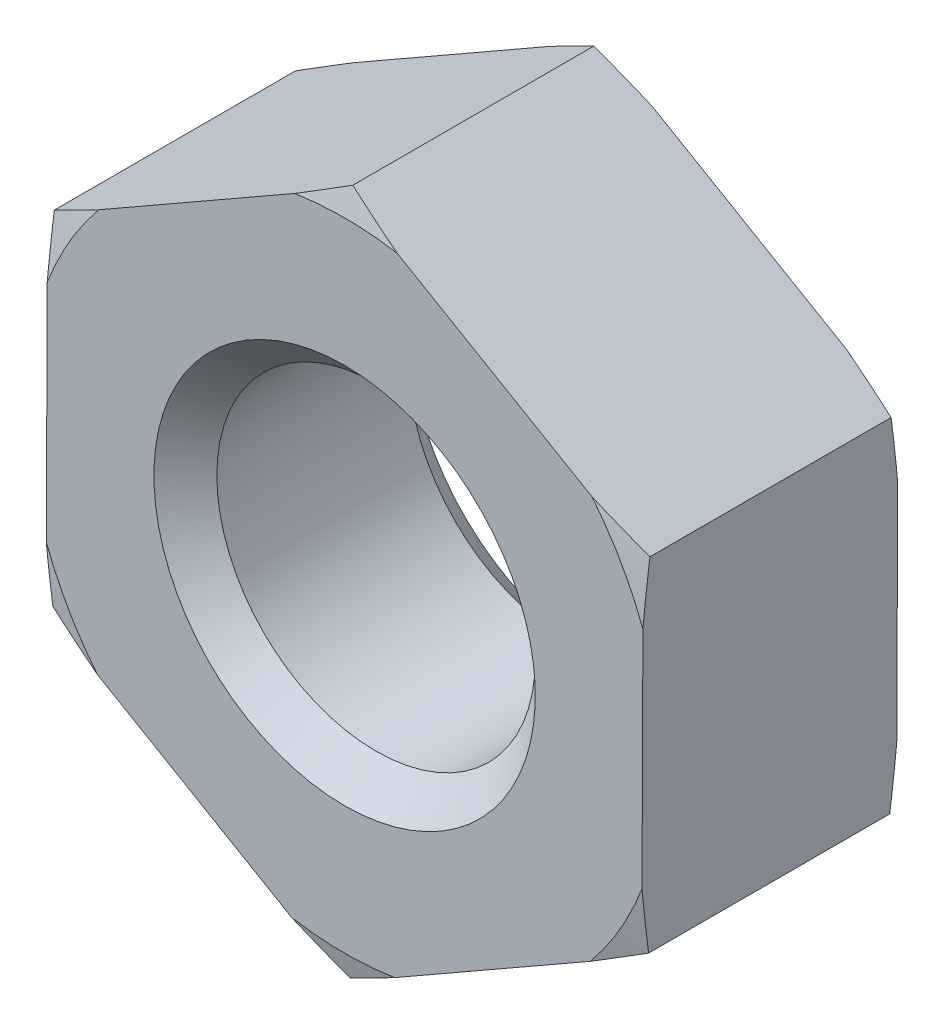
ISO-10303-21;
HEADER;
FILE_DESCRIPTION(('STEP AP214'),'2;1');
FILE_NAME('part.step','',(''),(''),'','','');
FILE_SCHEMA(('AUTOMOTIVE_DESIGN { 1 0 10303 214 1 1 1 1 }'));
ENDSEC;
DATA;
#1=APPLICATION_CONTEXT('core data for automotive mechanical design processes');
#2=APPLICATION_PROTOCOL_DEFINITION('international standard','automotive_design',2000,#1);
#3=PRODUCT_CONTEXT('',#1,'mechanical');
#4=PRODUCT('Part','Part','',(#3));
#5=PRODUCT_RELATED_PRODUCT_CATEGORY('part','',(#4));
#6=PRODUCT_DEFINITION_FORMATION('','',#4);
#7=PRODUCT_DEFINITION_CONTEXT('part definition',#1,'design');
#8=PRODUCT_DEFINITION('design','',#6,#7);
#9=PRODUCT_DEFINITION_SHAPE('','',#8);
#10=(LENGTH_UNIT() NAMED_UNIT(*) SI_UNIT(.MILLI.,.METRE.));
#11=(NAMED_UNIT(*) PLANE_ANGLE_UNIT() SI_UNIT($,.RADIAN.));
#12=(NAMED_UNIT(*) SI_UNIT($,.STERADIAN.) SOLID_ANGLE_UNIT());
#13=UNCERTAINTY_MEASURE_WITH_UNIT(LENGTH_MEASURE(1.E-05),#10,'distance_accuracy_value','');
#14=(GEOMETRIC_REPRESENTATION_CONTEXT(3) GLOBAL_UNCERTAINTY_ASSIGNED_CONTEXT((#13)) GLOBAL_UNIT_ASSIGNED_CONTEXT((#10,
#11,#12)) REPRESENTATION_CONTEXT('',''));
#15=CARTESIAN_POINT('',(0.,0.,0.));
#16=DIRECTION('',(0.,0.,1.));
#17=DIRECTION('',(1.,0.,0.));
#18=AXIS2_PLACEMENT_3D('',#15,#16,#17);
#19=CARTESIAN_POINT('',(0.,0.,1.13686837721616E-10));
#20=DIRECTION('',(0.,0.,-1.));
#21=DIRECTION('',(-1.,0.,0.));
#22=AXIS2_PLACEMENT_3D('',#19,#20,#21);
#23=CONICAL_SURFACE('',#22,1.19761904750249,0.785398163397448);
#24=CARTESIAN_POINT('',(0.,0.,0.197619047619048));
#25=DIRECTION('',(0.,0.,-1.));
#26=DIRECTION('',(-1.,0.,0.));
#27=AXIS2_PLACEMENT_3D('',#24,#25,#26);
#28=CIRCLE('',#27,1.);
#29=CARTESIAN_POINT('',(-1.,0.,0.197619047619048));
#30=VERTEX_POINT('',#29);
#31=EDGE_CURVE('E172',#30,#30,#28,.F.);
#32=ORIENTED_EDGE('',*,*,#31,.T.);
#33=EDGE_LOOP('',(#32));
#34=FACE_BOUND('',#33,.T.);
#35=CARTESIAN_POINT('',(0.,0.,5.6843418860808E-11));
#36=DIRECTION('',(0.,0.,-1.));
#37=DIRECTION('',(-1.,0.,0.));
#38=AXIS2_PLACEMENT_3D('',#35,#36,#37);
#39=CIRCLE('',#38,1.19761904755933);
#40=CARTESIAN_POINT('',(-1.19761904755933,0.,5.6843418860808E-11));
#41=VERTEX_POINT('',#40);
#42=EDGE_CURVE('E19',#41,#41,#39,.F.);
#43=ORIENTED_EDGE('',*,*,#42,.F.);
#44=EDGE_LOOP('',(#43));
#45=FACE_BOUND('',#44,.T.);
#46=ADVANCED_FACE('F16',(#34,#45),#23,.F.);
#47=CARTESIAN_POINT('',(0.,0.,1.6));
#48=DIRECTION('',(0.,0.,-1.));
#49=DIRECTION('',(-1.,0.,0.));
#50=AXIS2_PLACEMENT_3D('',#47,#48,#49);
#51=CYLINDRICAL_SURFACE('',#50,1.);
#52=ORIENTED_EDGE('',*,*,#31,.F.);
#53=EDGE_LOOP('',(#52));
#54=FACE_BOUND('',#53,.T.);
#55=CARTESIAN_POINT('',(0.,0.,1.4023809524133));
#56=DIRECTION('',(0.,0.,1.));
#57=DIRECTION('',(1.,0.,0.));
#58=AXIS2_PLACEMENT_3D('',#55,#56,#57);
#59=CIRCLE('',#58,0.999999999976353);
#60=CARTESIAN_POINT('',(0.999999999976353,0.,1.4023809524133));
#61=VERTEX_POINT('',#60);
#62=EDGE_CURVE('E165',#61,#61,#59,.T.);
#63=ORIENTED_EDGE('',*,*,#62,.T.);
#64=EDGE_LOOP('',(#63));
#65=FACE_BOUND('',#64,.T.);
#66=ADVANCED_FACE('F237',(#54,#65),#51,.F.);
#67=CARTESIAN_POINT('',(0.,0.,0.0431291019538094));
#68=DIRECTION('',(0.,0.,1.));
#69=DIRECTION('',(1.,0.,0.));
#70=AXIS2_PLACEMENT_3D('',#67,#68,#69);
#71=CONICAL_SURFACE('',#70,2.16095999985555,1.30899693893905);
#72=CARTESIAN_POINT('',(0.,0.,-2.84217229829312E-11));
#73=DIRECTION('',(0.,0.,1.));
#74=DIRECTION('',(1.,0.,0.));
#75=AXIS2_PLACEMENT_3D('',#72,#73,#74);
#76=CIRCLE('',#75,2.00000000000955);
#77=CARTESIAN_POINT('',(-0.314678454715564,1.97508923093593,-2.95567609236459E-11));
#78=VERTEX_POINT('',#77);
#79=CARTESIAN_POINT('',(0.33020715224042,1.97255246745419,-1.42108614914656E-11));
#80=VERTEX_POINT('',#79);
#81=EDGE_CURVE('E137',#78,#80,#76,.F.);
#82=ORIENTED_EDGE('',*,*,#81,.F.);
#83=CARTESIAN_POINT('',(-0.314678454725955,1.97508923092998,-3.06918093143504E-11));
#84=CARTESIAN_POINT('',(-0.287687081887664,1.99053146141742,0.0029481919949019));
#85=CARTESIAN_POINT('',(-0.260709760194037,2.00596565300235,0.00606500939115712));
#86=CARTESIAN_POINT('',(-0.206786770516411,2.03681592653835,0.0126169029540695));
#87=CARTESIAN_POINT('',(-0.179841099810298,2.05223201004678,0.0160519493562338));
#88=CARTESIAN_POINT('',(-0.125980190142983,2.08304676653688,0.0232218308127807));
#89=CARTESIAN_POINT('',(-0.0990649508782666,2.0984454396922,0.0269566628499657));
#90=CARTESIAN_POINT('',(-0.0452624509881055,2.12922677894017,0.0347078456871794));
#91=CARTESIAN_POINT('',(-0.018375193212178,2.14460944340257,0.0387242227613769));
#92=CARTESIAN_POINT('',(0.00849664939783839,2.15998328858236,0.0428718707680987));
#93=B_SPLINE_CURVE_WITH_KNOTS('',3,(#83,#84,#85,#86,#87,#88,#89,#90,#91,#92),.UNSPECIFIED.,.F.,
.F.,(4,2,2,2,4),(0.,0.0937072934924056,0.187405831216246,0.281103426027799,0.374809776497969),.UNSPECIFIED.);
#94=CARTESIAN_POINT('',(0.00849664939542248,2.15998328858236,0.0428718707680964));
#95=VERTEX_POINT('',#94);
#96=EDGE_CURVE('E140',#78,#95,#93,.T.);
#97=ORIENTED_EDGE('',*,*,#96,.T.);
#98=CARTESIAN_POINT('',(0.00849664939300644,2.15998328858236,0.0428718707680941));
#99=CARTESIAN_POINT('',(0.0352467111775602,2.14439851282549,0.0387242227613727));
#100=CARTESIAN_POINT('',(0.0620121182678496,2.12880479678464,0.0347078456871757));
#101=CARTESIAN_POINT('',(0.115570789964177,2.09760113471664,0.0269566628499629));
#102=CARTESIAN_POINT('',(0.14236405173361,2.08199119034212,0.0232218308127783));
#103=CARTESIAN_POINT('',(0.195980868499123,2.05075365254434,0.0160519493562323));
#104=CARTESIAN_POINT('',(0.22280442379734,2.03512605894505,0.0126169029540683));
#105=CARTESIAN_POINT('',(0.276483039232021,2.00385251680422,0.00606500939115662));
#106=CARTESIAN_POINT('',(0.303338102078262,1.98820656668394,0.00294819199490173));
#107=CARTESIAN_POINT('',(0.330207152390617,1.97255246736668,-3.06916143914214E-11));
#108=B_SPLINE_CURVE_WITH_KNOTS('',3,(#98,#99,#100,#101,#102,#103,#104,#105,#106,#107),
.UNSPECIFIED.,.F.,.F.,(4,2,2,2,4),(0.,0.0937063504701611,0.187403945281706,0.281102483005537,
0.374809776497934),.UNSPECIFIED.);
#109=EDGE_CURVE('E142',#95,#80,#108,.T.);
#110=ORIENTED_EDGE('',*,*,#109,.T.);
#111=EDGE_LOOP('',(#82,#97,#110));
#112=FACE_BOUND('',#111,.T.);
#113=ADVANCED_FACE('F139',(#112),#71,.T.);
#114=CARTESIAN_POINT('',(0.,0.,0.0431291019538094));
#115=DIRECTION('',(0.,0.,1.));
#116=DIRECTION('',(1.,0.,0.));
#117=AXIS2_PLACEMENT_3D('',#114,#115,#116);
#118=CONICAL_SURFACE('',#117,2.16095999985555,1.30899693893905);
#119=CARTESIAN_POINT('',(1.87484872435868,1.07263333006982,0.0428718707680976));
#120=CARTESIAN_POINT('',(1.87472694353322,1.04167470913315,0.0387242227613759));
#121=CARTESIAN_POINT('',(1.87460509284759,1.0106983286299,0.0347078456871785));
#122=CARTESIAN_POINT('',(1.87436126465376,0.948713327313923,0.0269566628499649));
#123=CARTESIAN_POINT('',(1.87423928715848,0.917704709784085,0.02322183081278));
#124=CARTESIAN_POINT('',(1.87399519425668,0.855652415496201,0.0160519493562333));
#125=CARTESIAN_POINT('',(1.87387307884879,0.824608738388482,0.0126169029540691));
#126=CARTESIAN_POINT('',(1.87362870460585,0.762484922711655,0.006065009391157));
#127=CARTESIAN_POINT('',(1.87350644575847,0.731404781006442,0.0029481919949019));
#128=CARTESIAN_POINT('',(1.87338412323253,0.700308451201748,-3.06917267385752E-11));
#129=B_SPLINE_CURVE_WITH_KNOTS('',3,(#119,#120,#121,#122,#123,#124,#125,#126,#127,#128),
.UNSPECIFIED.,.F.,.F.,(4,2,2,2,4),(0.,0.0937063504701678,0.187403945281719,0.281102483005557,
0.374809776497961),.UNSPECIFIED.);
#130=CARTESIAN_POINT('',(1.87484872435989,1.07263333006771,0.0428718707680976));
#131=VERTEX_POINT('',#130);
#132=CARTESIAN_POINT('',(1.87338412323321,0.700308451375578,-1.42108614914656E-11));
#133=VERTEX_POINT('',#132);
#134=EDGE_CURVE('E300',#131,#133,#129,.T.);
#135=ORIENTED_EDGE('',*,*,#134,.T.);
#136=CARTESIAN_POINT('',(0.,0.,-2.84217229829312E-11));
#137=DIRECTION('',(0.,0.,1.));
#138=DIRECTION('',(1.,0.,0.));
#139=AXIS2_PLACEMENT_3D('',#136,#137,#138);
#140=CIRCLE('',#139,2.00000000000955);
#141=CARTESIAN_POINT('',(1.5531382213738,1.26006415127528,-2.9556690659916E-11));
#142=VERTEX_POINT('',#141);
#143=EDGE_CURVE('E147',#142,#133,#140,.F.);
#144=ORIENTED_EDGE('',*,*,#143,.F.);
#145=CARTESIAN_POINT('',(1.55313822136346,1.2600641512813,-3.06916818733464E-11));
#146=CARTESIAN_POINT('',(1.58000727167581,1.24441005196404,0.00294819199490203));
#147=CARTESIAN_POINT('',(1.60686233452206,1.22876410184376,0.00606500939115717));
#148=CARTESIAN_POINT('',(1.66054094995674,1.19749055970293,0.0126169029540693));
#149=CARTESIAN_POINT('',(1.68736450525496,1.18186296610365,0.0160519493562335));
#150=CARTESIAN_POINT('',(1.74098132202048,1.15062542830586,0.0232218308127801));
#151=CARTESIAN_POINT('',(1.76777458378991,1.13501548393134,0.026956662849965));
#152=CARTESIAN_POINT('',(1.82133325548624,1.10381182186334,0.0347078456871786));
#153=CARTESIAN_POINT('',(1.84809866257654,1.08821810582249,0.038724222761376));
#154=CARTESIAN_POINT('',(1.87484872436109,1.07263333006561,0.0428718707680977));
#155=B_SPLINE_CURVE_WITH_KNOTS('',3,(#145,#146,#147,#148,#149,#150,#151,#152,#153,#154),
.UNSPECIFIED.,.F.,.F.,(4,2,2,2,4),(0.,0.0937072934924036,0.187405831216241,0.281103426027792,
0.37480977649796),.UNSPECIFIED.);
#156=EDGE_CURVE('E265',#142,#131,#155,.T.);
#157=ORIENTED_EDGE('',*,*,#156,.T.);
#158=EDGE_LOOP('',(#135,#144,#157));
#159=FACE_BOUND('',#158,.T.);
#160=ADVANCED_FACE('F244',(#159),#118,.T.);
#161=CARTESIAN_POINT('',(0.,0.,0.0431291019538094));
#162=DIRECTION('',(0.,0.,1.));
#163=DIRECTION('',(1.,0.,0.));
#164=AXIS2_PLACEMENT_3D('',#161,#162,#163);
#165=CONICAL_SURFACE('',#164,2.16095999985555,1.30899693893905);
#166=CARTESIAN_POINT('',(0.,0.,-2.84217229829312E-11));
#167=DIRECTION('',(0.,0.,1.));
#168=DIRECTION('',(1.,0.,0.));
#169=AXIS2_PLACEMENT_3D('',#166,#167,#168);
#170=CIRCLE('',#169,2.00000000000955);
#171=CARTESIAN_POINT('',(1.86781667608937,-0.715025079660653,-2.95567432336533E-11));
#172=VERTEX_POINT('',#171);
#173=CARTESIAN_POINT('',(1.5431769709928,-1.27224401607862,-1.42108614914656E-11));
#174=VERTEX_POINT('',#173);
#175=EDGE_CURVE('E670',#172,#174,#170,.F.);
#176=ORIENTED_EDGE('',*,*,#175,.F.);
#177=CARTESIAN_POINT('',(1.86781667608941,-0.715025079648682,-3.06917862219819E-11));
#178=CARTESIAN_POINT('',(1.86769435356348,-0.746121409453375,0.00294819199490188));
#179=CARTESIAN_POINT('',(1.8675720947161,-0.777201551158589,0.00606500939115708));
#180=CARTESIAN_POINT('',(1.86732772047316,-0.839325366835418,0.0126169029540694));
#181=CARTESIAN_POINT('',(1.86720560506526,-0.870369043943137,0.0160519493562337));
#182=CARTESIAN_POINT('',(1.86696151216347,-0.932421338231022,0.0232218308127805));
#183=CARTESIAN_POINT('',(1.86683953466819,-0.96342995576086,0.0269566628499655));
#184=CARTESIAN_POINT('',(1.86659570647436,-1.02541495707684,0.0347078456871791));
#185=CARTESIAN_POINT('',(1.86647385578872,-1.05639133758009,0.0387242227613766));
#186=CARTESIAN_POINT('',(1.86635207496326,-1.08734995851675,0.0428718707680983));
#187=B_SPLINE_CURVE_WITH_KNOTS('',3,(#177,#178,#179,#180,#181,#182,#183,#184,#185,#186),
.UNSPECIFIED.,.F.,.F.,(4,2,2,2,4),(0.,0.093707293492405,0.187405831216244,0.281103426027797,
0.374809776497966),.UNSPECIFIED.);
#188=CARTESIAN_POINT('',(1.86635207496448,-1.08734995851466,0.0428718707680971));
#189=VERTEX_POINT('',#188);
#190=EDGE_CURVE('E322',#172,#189,#187,.T.);
#191=ORIENTED_EDGE('',*,*,#190,.T.);
#192=CARTESIAN_POINT('',(1.86635207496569,-1.08734995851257,0.042871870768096));
#193=CARTESIAN_POINT('',(1.83948023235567,-1.10272380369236,0.0387242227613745));
#194=CARTESIAN_POINT('',(1.81259297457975,-1.11810646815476,0.0347078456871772));
#195=CARTESIAN_POINT('',(1.75879047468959,-1.14888780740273,0.026956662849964));
#196=CARTESIAN_POINT('',(1.73187523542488,-1.16428648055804,0.0232218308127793));
#197=CARTESIAN_POINT('',(1.67801432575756,-1.19510123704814,0.0160519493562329));
#198=CARTESIAN_POINT('',(1.65106865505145,-1.21051732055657,0.0126169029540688));
#199=CARTESIAN_POINT('',(1.59714566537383,-1.24136759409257,0.00606500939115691));
#200=CARTESIAN_POINT('',(1.5701683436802,-1.2568017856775,0.00294819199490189));
#201=CARTESIAN_POINT('',(1.54317697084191,-1.27224401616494,-3.06916982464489E-11));
#202=B_SPLINE_CURVE_WITH_KNOTS('',3,(#192,#193,#194,#195,#196,#197,#198,#199,#200,#201),
.UNSPECIFIED.,.F.,.F.,(4,2,2,2,4),(0.,0.0937063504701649,0.187403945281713,0.281102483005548,
0.374809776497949),.UNSPECIFIED.);
#203=EDGE_CURVE('E337',#189,#174,#202,.T.);
#204=ORIENTED_EDGE('',*,*,#203,.T.);
#205=EDGE_LOOP('',(#176,#191,#204));
#206=FACE_BOUND('',#205,.T.);
#207=ADVANCED_FACE('F327',(#206),#165,.T.);
#208=CARTESIAN_POINT('',(0.,0.,0.0431291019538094));
#209=DIRECTION('',(0.,0.,1.));
#210=DIRECTION('',(1.,0.,0.));
#211=AXIS2_PLACEMENT_3D('',#208,#209,#210);
#212=CONICAL_SURFACE('',#211,2.16095999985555,1.30899693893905);
#213=CARTESIAN_POINT('',(0.,0.,-2.84217229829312E-11));
#214=DIRECTION('',(0.,0.,1.));
#215=DIRECTION('',(1.,0.,0.));
#216=AXIS2_PLACEMENT_3D('',#213,#214,#215);
#217=CIRCLE('',#216,2.00000000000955);
#218=CARTESIAN_POINT('',(0.314678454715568,-1.97508923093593,-2.95567390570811E-11));
#219=VERTEX_POINT('',#218);
#220=CARTESIAN_POINT('',(-0.330207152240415,-1.97255246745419,-1.42108614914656E-11));
#221=VERTEX_POINT('',#220);
#222=EDGE_CURVE('E668',#219,#221,#217,.F.);
#223=ORIENTED_EDGE('',*,*,#222,.F.);
#224=CARTESIAN_POINT('',(0.314678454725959,-1.97508923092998,-3.06917586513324E-11));
#225=CARTESIAN_POINT('',(0.287687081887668,-1.99053146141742,0.00294819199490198));
#226=CARTESIAN_POINT('',(0.26070976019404,-2.00596565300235,0.00606500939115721));
#227=CARTESIAN_POINT('',(0.206786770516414,-2.03681592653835,0.0126169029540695));
#228=CARTESIAN_POINT('',(0.179841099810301,-2.05223201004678,0.0160519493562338));
#229=CARTESIAN_POINT('',(0.125980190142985,-2.08304676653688,0.0232218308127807));
#230=CARTESIAN_POINT('',(0.0990649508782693,-2.0984454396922,0.0269566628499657));
#231=CARTESIAN_POINT('',(0.0452624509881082,-2.12922677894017,0.0347078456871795));
#232=CARTESIAN_POINT('',(0.0183751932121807,-2.14460944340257,0.038724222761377));
#233=CARTESIAN_POINT('',(-0.0084966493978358,-2.15998328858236,0.0428718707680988));
#234=B_SPLINE_CURVE_WITH_KNOTS('',3,(#224,#225,#226,#227,#228,#229,#230,#231,#232,#233),
.UNSPECIFIED.,.F.,.F.,(4,2,2,2,4),(0.,0.0937072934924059,0.187405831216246,0.2811034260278,
0.37480977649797),.UNSPECIFIED.);
#235=CARTESIAN_POINT('',(-0.00849664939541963,-2.15998328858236,0.0428718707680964));
#236=VERTEX_POINT('',#235);
#237=EDGE_CURVE('E345',#219,#236,#234,.T.);
#238=ORIENTED_EDGE('',*,*,#237,.T.);
#239=CARTESIAN_POINT('',(-0.0084966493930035,-2.15998328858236,0.042871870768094));
#240=CARTESIAN_POINT('',(-0.0352467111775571,-2.14439851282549,0.0387242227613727));
#241=CARTESIAN_POINT('',(-0.0620121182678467,-2.12880479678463,0.0347078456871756));
#242=CARTESIAN_POINT('',(-0.115570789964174,-2.09760113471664,0.0269566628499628));
#243=CARTESIAN_POINT('',(-0.142364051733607,-2.08199119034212,0.0232218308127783));
#244=CARTESIAN_POINT('',(-0.19598086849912,-2.05075365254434,0.0160519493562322));
#245=CARTESIAN_POINT('',(-0.222804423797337,-2.03512605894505,0.0126169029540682));
#246=CARTESIAN_POINT('',(-0.276483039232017,-2.00385251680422,0.00606500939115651));
#247=CARTESIAN_POINT('',(-0.303338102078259,-1.98820656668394,0.00294819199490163));
#248=CARTESIAN_POINT('',(-0.330207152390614,-1.97255246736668,-3.06917094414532E-11));
#249=B_SPLINE_CURVE_WITH_KNOTS('',3,(#239,#240,#241,#242,#243,#244,#245,#246,#247,#248),
.UNSPECIFIED.,.F.,.F.,(4,2,2,2,4),(0.,0.093706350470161,0.187403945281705,0.281102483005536,
0.374809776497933),.UNSPECIFIED.);
#250=EDGE_CURVE('E377',#236,#221,#249,.T.);
#251=ORIENTED_EDGE('',*,*,#250,.T.);
#252=EDGE_LOOP('',(#223,#238,#251));
#253=FACE_BOUND('',#252,.T.);
#254=ADVANCED_FACE('F331',(#253),#212,.T.);
#255=CARTESIAN_POINT('',(0.,0.,0.0431291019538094));
#256=DIRECTION('',(0.,0.,1.));
#257=DIRECTION('',(1.,0.,0.));
#258=AXIS2_PLACEMENT_3D('',#255,#256,#257);
#259=CONICAL_SURFACE('',#258,2.16095999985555,1.30899693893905);
#260=CARTESIAN_POINT('',(0.,0.,-2.84217229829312E-11));
#261=DIRECTION('',(0.,0.,1.));
#262=DIRECTION('',(1.,0.,0.));
#263=AXIS2_PLACEMENT_3D('',#260,#261,#262);
#264=CIRCLE('',#263,2.00000000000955);
#265=CARTESIAN_POINT('',(-1.5531382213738,-1.26006415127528,-2.95567548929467E-11));
#266=VERTEX_POINT('',#265);
#267=CARTESIAN_POINT('',(-1.87338412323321,-0.700308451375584,-1.42108614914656E-11));
#268=VERTEX_POINT('',#267);
#269=EDGE_CURVE('E667',#266,#268,#264,.F.);
#270=ORIENTED_EDGE('',*,*,#269,.F.);
#271=CARTESIAN_POINT('',(-1.55313822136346,-1.2600641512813,-3.06917887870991E-11));
#272=CARTESIAN_POINT('',(-1.58000727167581,-1.24441005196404,0.00294819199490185));
#273=CARTESIAN_POINT('',(-1.60686233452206,-1.22876410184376,0.00606500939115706));
#274=CARTESIAN_POINT('',(-1.66054094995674,-1.19749055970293,0.0126169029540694));
#275=CARTESIAN_POINT('',(-1.68736450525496,-1.18186296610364,0.0160519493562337));
#276=CARTESIAN_POINT('',(-1.74098132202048,-1.15062542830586,0.0232218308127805));
#277=CARTESIAN_POINT('',(-1.76777458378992,-1.13501548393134,0.0269566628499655));
#278=CARTESIAN_POINT('',(-1.82133325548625,-1.10381182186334,0.0347078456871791));
#279=CARTESIAN_POINT('',(-1.84809866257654,-1.08821810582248,0.0387242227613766));
#280=CARTESIAN_POINT('',(-1.8748487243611,-1.07263333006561,0.0428718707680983));
#281=B_SPLINE_CURVE_WITH_KNOTS('',3,(#271,#272,#273,#274,#275,#276,#277,#278,#279,#280),
.UNSPECIFIED.,.F.,.F.,(4,2,2,2,4),(0.,0.0937072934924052,0.187405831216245,0.281103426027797,
0.374809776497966),.UNSPECIFIED.);
#282=CARTESIAN_POINT('',(-1.87484872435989,-1.0726333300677,0.042871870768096));
#283=VERTEX_POINT('',#282);
#284=EDGE_CURVE('E397',#266,#283,#281,.T.);
#285=ORIENTED_EDGE('',*,*,#284,.T.);
#286=CARTESIAN_POINT('',(-1.87484872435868,-1.07263333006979,0.0428718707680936));
#287=CARTESIAN_POINT('',(-1.87472694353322,-1.04167470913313,0.0387242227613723));
#288=CARTESIAN_POINT('',(-1.87460509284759,-1.01069832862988,0.0347078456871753));
#289=CARTESIAN_POINT('',(-1.87436126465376,-0.948713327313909,0.0269566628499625));
#290=CARTESIAN_POINT('',(-1.87423928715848,-0.917704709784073,0.023221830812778));
#291=CARTESIAN_POINT('',(-1.87399519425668,-0.855652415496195,0.0160519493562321));
#292=CARTESIAN_POINT('',(-1.87387307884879,-0.824608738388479,0.0126169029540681));
#293=CARTESIAN_POINT('',(-1.87362870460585,-0.762484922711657,0.00606500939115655));
#294=CARTESIAN_POINT('',(-1.87350644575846,-0.731404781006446,0.00294819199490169));
#295=CARTESIAN_POINT('',(-1.87338412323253,-0.700308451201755,-3.06916858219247E-11));
#296=B_SPLINE_CURVE_WITH_KNOTS('',3,(#286,#287,#288,#289,#290,#291,#292,#293,#294,#295),
.UNSPECIFIED.,.F.,.F.,(4,2,2,2,4),(0.,0.0937063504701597,0.187403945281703,0.281102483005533,
0.374809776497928),.UNSPECIFIED.);
#297=EDGE_CURVE('E410',#283,#268,#296,.T.);
#298=ORIENTED_EDGE('',*,*,#297,.T.);
#299=EDGE_LOOP('',(#270,#285,#298));
#300=FACE_BOUND('',#299,.T.);
#301=ADVANCED_FACE('F402',(#300),#259,.T.);
#302=CARTESIAN_POINT('',(1.87484872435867,1.07263333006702,0.));
#303=DIRECTION('',(0.,0.,-1.));
#304=DIRECTION('',(-1.,0.,0.));
#305=AXIS2_PLACEMENT_3D('',#302,#303,#304);
#306=PLANE('',#305);
#307=DIRECTION('',(-0.864051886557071,0.503402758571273,0.));
#308=VECTOR('',#307,1.);
#309=CARTESIAN_POINT('',(-1.87484872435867,-1.07263333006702,0.));
#310=LINE('',#309,#308);
#311=EDGE_CURVE('E401',#221,#266,#310,.T.);
#312=ORIENTED_EDGE('',*,*,#311,.T.);
#313=ORIENTED_EDGE('',*,*,#269,.T.);
#314=DIRECTION('',(0.00393363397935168,0.999992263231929,0.));
#315=VECTOR('',#314,1.);
#316=CARTESIAN_POINT('',(-1.86635207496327,1.08734995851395,0.));
#317=LINE('',#316,#315);
#318=CARTESIAN_POINT('',(-1.86781667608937,0.715025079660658,-2.95566867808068E-11));
#319=VERTEX_POINT('',#318);
#320=EDGE_CURVE('E415',#268,#319,#317,.T.);
#321=ORIENTED_EDGE('',*,*,#320,.T.);
#322=CARTESIAN_POINT('',(0.,0.,-2.84217229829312E-11));
#323=DIRECTION('',(0.,0.,1.));
#324=DIRECTION('',(1.,0.,0.));
#325=AXIS2_PLACEMENT_3D('',#322,#323,#324);
#326=CIRCLE('',#325,2.00000000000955);
#327=CARTESIAN_POINT('',(-1.5431769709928,1.27224401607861,-1.42108614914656E-11));
#328=VERTEX_POINT('',#327);
#329=EDGE_CURVE('E162',#328,#319,#326,.T.);
#330=ORIENTED_EDGE('',*,*,#329,.F.);
#331=DIRECTION('',(0.867985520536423,0.496589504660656,0.));
#332=VECTOR('',#331,1.);
#333=CARTESIAN_POINT('',(0.008496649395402,2.15998328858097,0.));
#334=LINE('',#333,#332);
#335=EDGE_CURVE('E152',#328,#78,#334,.T.);
#336=ORIENTED_EDGE('',*,*,#335,.T.);
#337=ORIENTED_EDGE('',*,*,#81,.T.);
#338=DIRECTION('',(0.86405188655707,-0.503402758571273,0.));
#339=VECTOR('',#338,1.);
#340=CARTESIAN_POINT('',(1.87484872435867,1.07263333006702,0.));
#341=LINE('',#340,#339);
#342=EDGE_CURVE('E264',#80,#142,#341,.T.);
#343=ORIENTED_EDGE('',*,*,#342,.T.);
#344=ORIENTED_EDGE('',*,*,#143,.T.);
#345=DIRECTION('',(-0.00393363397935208,-0.999992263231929,0.));
#346=VECTOR('',#345,1.);
#347=CARTESIAN_POINT('',(1.86635207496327,-1.08734995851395,0.));
#348=LINE('',#347,#346);
#349=EDGE_CURVE('E326',#133,#172,#348,.T.);
#350=ORIENTED_EDGE('',*,*,#349,.T.);
#351=ORIENTED_EDGE('',*,*,#175,.T.);
#352=DIRECTION('',(-0.867985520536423,-0.496589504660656,0.));
#353=VECTOR('',#352,1.);
#354=CARTESIAN_POINT('',(-0.00849664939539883,-2.15998328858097,0.));
#355=LINE('',#354,#353);
#356=EDGE_CURVE('E343',#174,#219,#355,.T.);
#357=ORIENTED_EDGE('',*,*,#356,.T.);
#358=ORIENTED_EDGE('',*,*,#222,.T.);
#359=EDGE_LOOP('',(#312,#313,#321,#330,#336,#337,#343,#344,#350,#351,#357,#358));
#360=FACE_BOUND('',#359,.T.);
#361=ORIENTED_EDGE('',*,*,#42,.T.);
#362=EDGE_LOOP('',(#361));
#363=FACE_BOUND('',#362,.T.);
#364=ADVANCED_FACE('F159',(#360,#363),#306,.T.);
#365=CARTESIAN_POINT('',(0.,0.,0.0431291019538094));
#366=DIRECTION('',(0.,0.,1.));
#367=DIRECTION('',(1.,0.,0.));
#368=AXIS2_PLACEMENT_3D('',#365,#366,#367);
#369=CONICAL_SURFACE('',#368,2.16095999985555,1.30899693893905);
#370=ORIENTED_EDGE('',*,*,#329,.T.);
#371=CARTESIAN_POINT('',(-1.86781667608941,0.715025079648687,-3.06916531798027E-11));
#372=CARTESIAN_POINT('',(-1.86769435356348,0.746121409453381,0.00294819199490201));
#373=CARTESIAN_POINT('',(-1.8675720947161,0.777201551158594,0.0060650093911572));
#374=CARTESIAN_POINT('',(-1.86732772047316,0.839325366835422,0.0126169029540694));
#375=CARTESIAN_POINT('',(-1.86720560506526,0.870369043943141,0.0160519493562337));
#376=CARTESIAN_POINT('',(-1.86696151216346,0.932421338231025,0.0232218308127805));
#377=CARTESIAN_POINT('',(-1.86683953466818,0.963429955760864,0.0269566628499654));
#378=CARTESIAN_POINT('',(-1.86659570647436,1.02541495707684,0.034707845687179));
#379=CARTESIAN_POINT('',(-1.86647385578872,1.05639133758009,0.0387242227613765));
#380=CARTESIAN_POINT('',(-1.86635207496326,1.08734995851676,0.0428718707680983));
#381=B_SPLINE_CURVE_WITH_KNOTS('',3,(#371,#372,#373,#374,#375,#376,#377,#378,#379,#380),
.UNSPECIFIED.,.F.,.F.,(4,2,2,2,4),(0.,0.0937072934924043,0.187405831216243,0.281103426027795,
0.374809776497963),.UNSPECIFIED.);
#382=CARTESIAN_POINT('',(-1.86635207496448,1.08734995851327,0.0428718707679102));
#383=VERTEX_POINT('',#382);
#384=EDGE_CURVE('E417',#319,#383,#381,.T.);
#385=ORIENTED_EDGE('',*,*,#384,.T.);
#386=CARTESIAN_POINT('',(-1.86635207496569,1.08734995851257,0.0428718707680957));
#387=CARTESIAN_POINT('',(-1.83948023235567,1.10272380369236,0.0387242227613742));
#388=CARTESIAN_POINT('',(-1.81259297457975,1.11810646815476,0.034707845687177));
#389=CARTESIAN_POINT('',(-1.75879047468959,1.14888780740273,0.0269566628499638));
#390=CARTESIAN_POINT('',(-1.73187523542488,1.16428648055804,0.0232218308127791));
#391=CARTESIAN_POINT('',(-1.67801432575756,1.19510123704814,0.0160519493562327));
#392=CARTESIAN_POINT('',(-1.65106865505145,1.21051732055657,0.0126169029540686));
#393=CARTESIAN_POINT('',(-1.59714566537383,1.24136759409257,0.00606500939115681));
#394=CARTESIAN_POINT('',(-1.5701683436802,1.2568017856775,0.00294819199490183));
#395=CARTESIAN_POINT('',(-1.54317697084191,1.27224401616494,-3.0691704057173E-11));
#396=B_SPLINE_CURVE_WITH_KNOTS('',3,(#386,#387,#388,#389,#390,#391,#392,#393,#394,#395),
.UNSPECIFIED.,.F.,.F.,(4,2,2,2,4),(0.,0.0937063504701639,0.187403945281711,0.281102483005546,
0.374809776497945),.UNSPECIFIED.);
#397=EDGE_CURVE('E163',#383,#328,#396,.T.);
#398=ORIENTED_EDGE('',*,*,#397,.T.);
#399=EDGE_LOOP('',(#370,#385,#398));
#400=FACE_BOUND('',#399,.T.);
#401=ADVANCED_FACE('F233',(#400),#369,.T.);
#402=CARTESIAN_POINT('',(0.,0.,1.60000000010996));
#403=DIRECTION('',(0.,0.,1.));
#404=DIRECTION('',(0.,-1.,0.));
#405=AXIS2_PLACEMENT_3D('',#402,#403,#404);
#406=CONICAL_SURFACE('',#405,1.19761904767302,0.785398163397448);
#407=CARTESIAN_POINT('',(0.,0.,1.60000000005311));
#408=DIRECTION('',(0.,0.,1.));
#409=DIRECTION('',(0.,-1.,0.));
#410=AXIS2_PLACEMENT_3D('',#407,#408,#409);
#411=CIRCLE('',#410,1.19761904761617);
#412=CARTESIAN_POINT('',(0.,-1.19761904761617,1.60000000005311));
#413=VERTEX_POINT('',#412);
#414=EDGE_CURVE('E195',#413,#413,#411,.T.);
#415=ORIENTED_EDGE('',*,*,#414,.T.);
#416=EDGE_LOOP('',(#415));
#417=FACE_BOUND('',#416,.T.);
#418=ORIENTED_EDGE('',*,*,#62,.F.);
#419=EDGE_LOOP('',(#418));
#420=FACE_BOUND('',#419,.T.);
#421=ADVANCED_FACE('F230',(#417,#420),#406,.F.);
#422=CARTESIAN_POINT('',(0.008496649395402,2.15998328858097,1.6));
#423=DIRECTION('',(0.496589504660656,-0.867985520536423,0.));
#424=DIRECTION('',(0.867985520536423,0.496589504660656,0.));
#425=AXIS2_PLACEMENT_3D('',#422,#423,#424);
#426=PLANE('',#425);
#427=DIRECTION('',(0.,0.,1.));
#428=VECTOR('',#427,1.);
#429=CARTESIAN_POINT('',(0.00849664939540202,2.15998328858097,1.6));
#430=LINE('',#429,#428);
#431=CARTESIAN_POINT('',(0.00849664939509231,2.15998328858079,1.5571281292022));
#432=VERTEX_POINT('',#431);
#433=EDGE_CURVE('E155',#432,#95,#430,.F.);
#434=ORIENTED_EDGE('',*,*,#433,.T.);
#435=ORIENTED_EDGE('',*,*,#96,.F.);
#436=ORIENTED_EDGE('',*,*,#335,.F.);
#437=ORIENTED_EDGE('',*,*,#397,.F.);
#438=DIRECTION('',(0.,0.,1.));
#439=VECTOR('',#438,1.);
#440=CARTESIAN_POINT('',(-1.86635207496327,1.08734995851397,1.6));
#441=LINE('',#440,#439);
#442=CARTESIAN_POINT('',(-1.86635203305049,1.08734998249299,1.55712813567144));
#443=VERTEX_POINT('',#442);
#444=EDGE_CURVE('E445',#383,#443,#441,.T.);
#445=ORIENTED_EDGE('',*,*,#444,.T.);
#446=CARTESIAN_POINT('',(-1.54317697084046,1.27224401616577,1.5999999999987));
#447=CARTESIAN_POINT('',(-1.57016833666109,1.25680178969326,1.59705180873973));
#448=CARTESIAN_POINT('',(-1.59714565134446,1.24136760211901,1.59393499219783));
#449=CARTESIAN_POINT('',(-1.65106862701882,1.21051733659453,1.58738310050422));
#450=CARTESIAN_POINT('',(-1.67801429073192,1.19510125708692,1.58394805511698));
#451=CARTESIAN_POINT('',(-1.73187518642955,1.16428650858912,1.57677817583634));
#452=CARTESIAN_POINT('',(-1.75879041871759,1.14888783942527,1.57304334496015));
#453=CARTESIAN_POINT('',(-1.81259290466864,1.11810650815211,1.56529216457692));
#454=CARTESIAN_POINT('',(-1.83948015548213,1.10272384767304,1.56127578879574));
#455=CARTESIAN_POINT('',(-1.8663519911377,1.08735000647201,1.55712814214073));
#456=B_SPLINE_CURVE_WITH_KNOTS('',3,(#446,#447,#448,#449,#450,#451,#452,#453,#454,#455),
.UNSPECIFIED.,.F.,.F.,(4,2,2,2,4),(0.,0.0937072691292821,0.187405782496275,0.281103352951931,
0.374809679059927),.UNSPECIFIED.);
#457=CARTESIAN_POINT('',(-1.54317697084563,1.27224401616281,1.59999999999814));
#458=VERTEX_POINT('',#457);
#459=EDGE_CURVE('E204',#458,#443,#456,.T.);
#460=ORIENTED_EDGE('',*,*,#459,.F.);
#461=DIRECTION('',(0.867985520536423,0.496589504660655,0.));
#462=VECTOR('',#461,1.);
#463=CARTESIAN_POINT('',(-1.54317697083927,1.27224401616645,1.6));
#464=LINE('',#463,#462);
#465=CARTESIAN_POINT('',(-0.314678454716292,1.97508923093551,1.59999999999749));
#466=VERTEX_POINT('',#465);
#467=EDGE_CURVE('E194',#458,#466,#464,.T.);
#468=ORIENTED_EDGE('',*,*,#467,.T.);
#469=CARTESIAN_POINT('',(0.0084966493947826,2.15998328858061,1.55712812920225));
#470=CARTESIAN_POINT('',(-0.0183751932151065,2.1446094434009,1.56127577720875));
#471=CARTESIAN_POINT('',(-0.0452624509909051,2.12922677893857,1.56529215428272));
#472=CARTESIAN_POINT('',(-0.0990649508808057,2.09844543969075,1.57304333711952));
#473=CARTESIAN_POINT('',(-0.12598019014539,2.08304676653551,1.5767781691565));
#474=CARTESIAN_POINT('',(-0.179841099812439,2.05223201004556,1.58394805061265));
#475=CARTESIAN_POINT('',(-0.206786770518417,2.0368159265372,1.58738309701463));
#476=CARTESIAN_POINT('',(-0.26070976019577,2.00596565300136,1.59393499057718));
#477=CARTESIAN_POINT('',(-0.287687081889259,1.9905314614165,1.59705180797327));
#478=CARTESIAN_POINT('',(-0.314678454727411,1.97508923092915,1.5999999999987));
#479=B_SPLINE_CURVE_WITH_KNOTS('',3,(#469,#470,#471,#472,#473,#474,#475,#476,#477,#478),
.UNSPECIFIED.,.F.,.F.,(4,2,2,2,4),(0.,0.0937063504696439,0.187403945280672,0.281102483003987,
0.374809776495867),.UNSPECIFIED.);
#480=EDGE_CURVE('E156',#432,#466,#479,.T.);
#481=ORIENTED_EDGE('',*,*,#480,.F.);
#482=EDGE_LOOP('',(#434,#435,#436,#437,#445,#460,#468,#481));
#483=FACE_BOUND('',#482,.T.);
#484=ADVANCED_FACE('F151',(#483),#426,.F.);
#485=CARTESIAN_POINT('',(0.,0.,1.55687089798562));
#486=DIRECTION('',(0.,0.,-1.));
#487=DIRECTION('',(0.,1.,0.));
#488=AXIS2_PLACEMENT_3D('',#485,#486,#487);
#489=CONICAL_SURFACE('',#488,2.16095999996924,1.30899693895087);
#490=ORIENTED_EDGE('',*,*,#480,.T.);
#491=CARTESIAN_POINT('',(0.,0.,1.59999999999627));
#492=DIRECTION('',(0.,0.,-1.));
#493=DIRECTION('',(0.,1.,0.));
#494=AXIS2_PLACEMENT_3D('',#491,#492,#493);
#495=CIRCLE('',#494,2.00000000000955);
#496=CARTESIAN_POINT('',(0.330207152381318,1.9725524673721,1.59999999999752));
#497=VERTEX_POINT('',#496);
#498=EDGE_CURVE('E191',#466,#497,#495,.T.);
#499=ORIENTED_EDGE('',*,*,#498,.T.);
#500=CARTESIAN_POINT('',(0.330207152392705,1.97255246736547,1.59999999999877));
#501=CARTESIAN_POINT('',(0.303338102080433,1.98820656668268,1.59705180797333));
#502=CARTESIAN_POINT('',(0.276483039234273,2.00385251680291,1.59393499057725));
#503=CARTESIAN_POINT('',(0.222804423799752,2.03512605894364,1.58738309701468));
#504=CARTESIAN_POINT('',(0.195980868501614,2.05075365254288,1.5839480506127));
#505=CARTESIAN_POINT('',(0.142364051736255,2.08199119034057,1.57677816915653));
#506=CARTESIAN_POINT('',(0.115570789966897,2.09760113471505,1.57304333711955));
#507=CARTESIAN_POINT('',(0.0620121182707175,2.12880479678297,1.56529215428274));
#508=CARTESIAN_POINT('',(0.0352467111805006,2.14439851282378,1.56127577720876));
#509=CARTESIAN_POINT('',(0.00849664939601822,2.15998328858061,1.55712812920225));
#510=B_SPLINE_CURVE_WITH_KNOTS('',3,(#500,#501,#502,#503,#504,#505,#506,#507,#508,#509),
.UNSPECIFIED.,.F.,.F.,(4,2,2,2,4),(0.,0.0937072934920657,0.187405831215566,0.28110342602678,
0.37480977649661),.UNSPECIFIED.);
#511=EDGE_CURVE('E270',#497,#432,#510,.T.);
#512=ORIENTED_EDGE('',*,*,#511,.T.);
#513=EDGE_LOOP('',(#490,#499,#512));
#514=FACE_BOUND('',#513,.T.);
#515=ADVANCED_FACE('F280',(#514),#489,.T.);
#516=CARTESIAN_POINT('',(1.87484872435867,1.07263333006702,1.6));
#517=DIRECTION('',(-0.503402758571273,-0.86405188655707,0.));
#518=DIRECTION('',(0.86405188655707,-0.503402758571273,0.));
#519=AXIS2_PLACEMENT_3D('',#516,#517,#518);
#520=PLANE('',#519);
#521=DIRECTION('',(0.,0.,1.));
#522=VECTOR('',#521,1.);
#523=CARTESIAN_POINT('',(1.87484872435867,1.07263333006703,1.6));
#524=LINE('',#523,#522);
#525=CARTESIAN_POINT('',(1.87484868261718,1.07263335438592,1.55712813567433));
#526=VERTEX_POINT('',#525);
#527=EDGE_CURVE('E299',#526,#131,#524,.F.);
#528=ORIENTED_EDGE('',*,*,#527,.T.);
#529=ORIENTED_EDGE('',*,*,#156,.F.);
#530=ORIENTED_EDGE('',*,*,#342,.F.);
#531=ORIENTED_EDGE('',*,*,#109,.F.);
#532=ORIENTED_EDGE('',*,*,#433,.F.);
#533=ORIENTED_EDGE('',*,*,#511,.F.);
#534=DIRECTION('',(0.86405188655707,-0.503402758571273,0.));
#535=VECTOR('',#534,1.);
#536=CARTESIAN_POINT('',(0.33020715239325,1.97255246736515,1.6));
#537=LINE('',#536,#535);
#538=CARTESIAN_POINT('',(1.55313822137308,1.2600641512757,1.59999999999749));
#539=VERTEX_POINT('',#538);
#540=EDGE_CURVE('E190',#497,#539,#537,.T.);
#541=ORIENTED_EDGE('',*,*,#540,.T.);
#542=CARTESIAN_POINT('',(1.87484864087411,1.07263337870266,1.55712814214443));
#543=CARTESIAN_POINT('',(1.84809858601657,1.08821815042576,1.56127578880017));
#544=CARTESIAN_POINT('',(1.82133318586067,1.10381186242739,1.56529216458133));
#545=CARTESIAN_POINT('',(1.76777452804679,1.13501551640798,1.57304334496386));
#546=CARTESIAN_POINT('',(1.7409812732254,1.15062545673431,1.57677817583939));
#547=CARTESIAN_POINT('',(1.68736447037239,1.18186298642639,1.58394805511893));
#548=CARTESIAN_POINT('',(1.66054092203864,1.19749057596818,1.58738310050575));
#549=CARTESIAN_POINT('',(1.60686232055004,1.228764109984,1.59393499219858));
#550=CARTESIAN_POINT('',(1.58000726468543,1.24441005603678,1.59705180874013));
#551=CARTESIAN_POINT('',(1.55313822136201,1.26006415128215,1.5999999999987));
#552=B_SPLINE_CURVE_WITH_KNOTS('',3,(#542,#543,#544,#545,#546,#547,#548,#549,#550,#551),
.UNSPECIFIED.,.F.,.F.,(4,2,2,2,4),(0.,0.0937063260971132,0.187403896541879,0.281102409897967,
0.37480967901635),.UNSPECIFIED.);
#553=EDGE_CURVE('E287',#526,#539,#552,.T.);
#554=ORIENTED_EDGE('',*,*,#553,.F.);
#555=EDGE_LOOP('',(#528,#529,#530,#531,#532,#533,#541,#554));
#556=FACE_BOUND('',#555,.T.);
#557=ADVANCED_FACE('F275',(#556),#520,.F.);
#558=CARTESIAN_POINT('',(0.,0.,1.55687089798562));
#559=DIRECTION('',(0.,0.,-1.));
#560=DIRECTION('',(0.,1.,0.));
#561=AXIS2_PLACEMENT_3D('',#558,#559,#560);
#562=CONICAL_SURFACE('',#561,2.16095999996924,1.30899693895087);
#563=CARTESIAN_POINT('',(0.,0.,1.59999999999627));
#564=DIRECTION('',(0.,0.,-1.));
#565=DIRECTION('',(0.,1.,0.));
#566=AXIS2_PLACEMENT_3D('',#563,#564,#565);
#567=CIRCLE('',#566,2.00000000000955);
#568=CARTESIAN_POINT('',(1.87338412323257,0.700308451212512,1.59999999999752));
#569=VERTEX_POINT('',#568);
#570=EDGE_CURVE('E187',#539,#569,#567,.T.);
#571=ORIENTED_EDGE('',*,*,#570,.T.);
#572=CARTESIAN_POINT('',(1.87338412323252,0.700308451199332,1.59999999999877));
#573=CARTESIAN_POINT('',(1.8735064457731,0.731404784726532,1.59705180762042));
#574=CARTESIAN_POINT('',(1.87362870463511,0.762484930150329,1.59393498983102));
#575=CARTESIAN_POINT('',(1.87387307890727,0.824608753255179,1.58738309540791));
#576=CARTESIAN_POINT('',(1.87399519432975,0.855652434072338,1.5839480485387));
#577=CARTESIAN_POINT('',(1.8742392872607,0.917704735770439,1.57677816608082));
#578=CARTESIAN_POINT('',(1.87436126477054,0.948713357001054,1.57304333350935));
#579=CARTESIAN_POINT('',(1.87460509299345,1.01069836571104,1.56529214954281));
#580=CARTESIAN_POINT('',(1.87472694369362,1.04167474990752,1.56127577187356));
#581=CARTESIAN_POINT('',(1.87484872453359,1.07263337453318,1.55712812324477));
#582=B_SPLINE_CURVE_WITH_KNOTS('',3,(#572,#573,#574,#575,#576,#577,#578,#579,#580,#581),
.UNSPECIFIED.,.F.,.F.,(4,2,2,2,4),(0.,0.0937073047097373,0.187405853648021,0.28110345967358,
0.374809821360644),.UNSPECIFIED.);
#583=EDGE_CURVE('E293',#569,#526,#582,.T.);
#584=ORIENTED_EDGE('',*,*,#583,.T.);
#585=ORIENTED_EDGE('',*,*,#553,.T.);
#586=EDGE_LOOP('',(#571,#584,#585));
#587=FACE_BOUND('',#586,.T.);
#588=ADVANCED_FACE('F279',(#587),#562,.T.);
#589=CARTESIAN_POINT('',(1.86635207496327,-1.08734995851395,1.6));
#590=DIRECTION('',(-0.999992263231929,0.00393363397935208,0.));
#591=DIRECTION('',(-0.00393363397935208,-0.999992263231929,0.));
#592=AXIS2_PLACEMENT_3D('',#589,#590,#591);
#593=PLANE('',#592);
#594=DIRECTION('',(0.,0.,1.));
#595=VECTOR('',#594,1.);
#596=CARTESIAN_POINT('',(1.86635207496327,-1.08734995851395,1.6));
#597=LINE('',#596,#595);
#598=CARTESIAN_POINT('',(1.86635207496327,-1.08734995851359,1.5571281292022));
#599=VERTEX_POINT('',#598);
#600=EDGE_CURVE('E344',#599,#189,#597,.F.);
#601=ORIENTED_EDGE('',*,*,#600,.T.);
#602=ORIENTED_EDGE('',*,*,#190,.F.);
#603=ORIENTED_EDGE('',*,*,#349,.F.);
#604=ORIENTED_EDGE('',*,*,#134,.F.);
#605=ORIENTED_EDGE('',*,*,#527,.F.);
#606=ORIENTED_EDGE('',*,*,#583,.F.);
#607=DIRECTION('',(-0.00393363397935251,-0.999992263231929,0.));
#608=VECTOR('',#607,1.);
#609=CARTESIAN_POINT('',(1.87338412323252,0.700308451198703,1.6));
#610=LINE('',#609,#608);
#611=CARTESIAN_POINT('',(1.86781667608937,-0.715025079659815,1.59999999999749));
#612=VERTEX_POINT('',#611);
#613=EDGE_CURVE('E186',#569,#612,#610,.T.);
#614=ORIENTED_EDGE('',*,*,#613,.T.);
#615=CARTESIAN_POINT('',(1.86635207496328,-1.08734995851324,1.55712812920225));
#616=CARTESIAN_POINT('',(1.86647385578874,-1.05639133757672,1.56127577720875));
#617=CARTESIAN_POINT('',(1.86659570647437,-1.02541495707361,1.56529215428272));
#618=CARTESIAN_POINT('',(1.8668395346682,-0.963429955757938,1.57304333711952));
#619=CARTESIAN_POINT('',(1.86696151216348,-0.932421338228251,1.5767781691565));
#620=CARTESIAN_POINT('',(1.86720560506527,-0.870369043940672,1.58394805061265));
#621=CARTESIAN_POINT('',(1.86732772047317,-0.839325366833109,1.58738309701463));
#622=CARTESIAN_POINT('',(1.8675720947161,-0.777201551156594,1.59393499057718));
#623=CARTESIAN_POINT('',(1.86769435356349,-0.746121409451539,1.59705180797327));
#624=CARTESIAN_POINT('',(1.86781667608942,-0.715025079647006,1.5999999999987));
#625=B_SPLINE_CURVE_WITH_KNOTS('',3,(#615,#616,#617,#618,#619,#620,#621,#622,#623,#624),
.UNSPECIFIED.,.F.,.F.,(4,2,2,2,4),(0.,0.0937063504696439,0.187403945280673,0.281102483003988,
0.374809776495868),.UNSPECIFIED.);
#626=EDGE_CURVE('E316',#599,#612,#625,.T.);
#627=ORIENTED_EDGE('',*,*,#626,.F.);
#628=EDGE_LOOP('',(#601,#602,#603,#604,#605,#606,#614,#627));
#629=FACE_BOUND('',#628,.T.);
#630=ADVANCED_FACE('F305',(#629),#593,.F.);
#631=CARTESIAN_POINT('',(0.,0.,1.55687089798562));
#632=DIRECTION('',(0.,0.,-1.));
#633=DIRECTION('',(0.,1.,0.));
#634=AXIS2_PLACEMENT_3D('',#631,#632,#633);
#635=CONICAL_SURFACE('',#634,2.16095999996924,1.30899693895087);
#636=ORIENTED_EDGE('',*,*,#626,.T.);
#637=CARTESIAN_POINT('',(0.,0.,1.59999999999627));
#638=DIRECTION('',(0.,0.,-1.));
#639=DIRECTION('',(0.,1.,0.));
#640=AXIS2_PLACEMENT_3D('',#637,#638,#639);
#641=CIRCLE('',#640,2.00000000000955);
#642=CARTESIAN_POINT('',(1.54317697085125,-1.27224401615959,1.59999999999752));
#643=VERTEX_POINT('',#642);
#644=EDGE_CURVE('E183',#612,#643,#641,.T.);
#645=ORIENTED_EDGE('',*,*,#644,.T.);
#646=CARTESIAN_POINT('',(1.54317697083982,-1.27224401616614,1.59999999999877));
#647=CARTESIAN_POINT('',(1.57016834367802,-1.25680178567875,1.59705180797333));
#648=CARTESIAN_POINT('',(1.59714566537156,-1.24136759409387,1.59393499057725));
#649=CARTESIAN_POINT('',(1.65106865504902,-1.21051732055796,1.58738309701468));
#650=CARTESIAN_POINT('',(1.67801432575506,-1.19510123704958,1.5839480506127));
#651=CARTESIAN_POINT('',(1.73187523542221,-1.16428648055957,1.57677816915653));
#652=CARTESIAN_POINT('',(1.75879047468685,-1.14888780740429,1.57304333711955));
#653=CARTESIAN_POINT('',(1.81259297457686,-1.11810646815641,1.56529215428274));
#654=CARTESIAN_POINT('',(1.83948023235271,-1.10272380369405,1.56127577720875));
#655=CARTESIAN_POINT('',(1.86635207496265,-1.08734995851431,1.55712812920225));
#656=B_SPLINE_CURVE_WITH_KNOTS('',3,(#646,#647,#648,#649,#650,#651,#652,#653,#654,#655),
.UNSPECIFIED.,.F.,.F.,(4,2,2,2,4),(0.,0.0937072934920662,0.187405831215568,0.281103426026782,
0.374809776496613),.UNSPECIFIED.);
#657=EDGE_CURVE('E350',#643,#599,#656,.T.);
#658=ORIENTED_EDGE('',*,*,#657,.T.);
#659=EDGE_LOOP('',(#636,#645,#658));
#660=FACE_BOUND('',#659,.T.);
#661=ADVANCED_FACE('F309',(#660),#635,.T.);
#662=CARTESIAN_POINT('',(-0.00849664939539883,-2.15998328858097,1.6));
#663=DIRECTION('',(-0.496589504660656,0.867985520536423,0.));
#664=DIRECTION('',(-0.867985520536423,-0.496589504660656,0.));
#665=AXIS2_PLACEMENT_3D('',#662,#663,#664);
#666=PLANE('',#665);
#667=DIRECTION('',(0.,0.,1.));
#668=VECTOR('',#667,1.);
#669=CARTESIAN_POINT('',(-0.00849664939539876,-2.15998328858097,1.6));
#670=LINE('',#669,#668);
#671=CARTESIAN_POINT('',(-0.00849664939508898,-2.15998328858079,1.5571281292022));
#672=VERTEX_POINT('',#671);
#673=EDGE_CURVE('E376',#672,#236,#670,.F.);
#674=ORIENTED_EDGE('',*,*,#673,.T.);
#675=ORIENTED_EDGE('',*,*,#237,.F.);
#676=ORIENTED_EDGE('',*,*,#356,.F.);
#677=ORIENTED_EDGE('',*,*,#203,.F.);
#678=ORIENTED_EDGE('',*,*,#600,.F.);
#679=ORIENTED_EDGE('',*,*,#657,.F.);
#680=DIRECTION('',(-0.867985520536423,-0.496589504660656,0.));
#681=VECTOR('',#680,1.);
#682=CARTESIAN_POINT('',(1.54317697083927,-1.27224401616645,1.6));
#683=LINE('',#682,#681);
#684=CARTESIAN_POINT('',(0.314678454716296,-1.97508923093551,1.59999999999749));
#685=VERTEX_POINT('',#684);
#686=EDGE_CURVE('E182',#643,#685,#683,.T.);
#687=ORIENTED_EDGE('',*,*,#686,.T.);
#688=CARTESIAN_POINT('',(-0.0084966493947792,-2.15998328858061,1.55712812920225));
#689=CARTESIAN_POINT('',(0.0183751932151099,-2.1446094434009,1.56127577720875));
#690=CARTESIAN_POINT('',(0.0452624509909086,-2.12922677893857,1.56529215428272));
#691=CARTESIAN_POINT('',(0.0990649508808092,-2.09844543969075,1.57304333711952));
#692=CARTESIAN_POINT('',(0.125980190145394,-2.08304676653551,1.5767781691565));
#693=CARTESIAN_POINT('',(0.179841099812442,-2.05223201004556,1.58394805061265));
#694=CARTESIAN_POINT('',(0.206786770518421,-2.0368159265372,1.58738309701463));
#695=CARTESIAN_POINT('',(0.260709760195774,-2.00596565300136,1.59393499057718));
#696=CARTESIAN_POINT('',(0.287687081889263,-1.9905314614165,1.59705180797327));
#697=CARTESIAN_POINT('',(0.314678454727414,-1.97508923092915,1.5999999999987));
#698=B_SPLINE_CURVE_WITH_KNOTS('',3,(#688,#689,#690,#691,#692,#693,#694,#695,#696,#697),
.UNSPECIFIED.,.F.,.F.,(4,2,2,2,4),(0.,0.0937063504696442,0.187403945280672,0.281102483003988,
0.374809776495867),.UNSPECIFIED.);
#699=EDGE_CURVE('E364',#672,#685,#698,.T.);
#700=ORIENTED_EDGE('',*,*,#699,.F.);
#701=EDGE_LOOP('',(#674,#675,#676,#677,#678,#679,#687,#700));
#702=FACE_BOUND('',#701,.T.);
#703=ADVANCED_FACE('F354',(#702),#666,.F.);
#704=CARTESIAN_POINT('',(0.,0.,1.55687089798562));
#705=DIRECTION('',(0.,0.,-1.));
#706=DIRECTION('',(0.,1.,0.));
#707=AXIS2_PLACEMENT_3D('',#704,#705,#706);
#708=CONICAL_SURFACE('',#707,2.16095999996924,1.30899693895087);
#709=ORIENTED_EDGE('',*,*,#699,.T.);
#710=CARTESIAN_POINT('',(0.,0.,1.59999999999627));
#711=DIRECTION('',(0.,0.,-1.));
#712=DIRECTION('',(0.,1.,0.));
#713=AXIS2_PLACEMENT_3D('',#710,#711,#712);
#714=CIRCLE('',#713,2.00000000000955);
#715=CARTESIAN_POINT('',(-0.330207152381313,-1.9725524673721,1.59999999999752));
#716=VERTEX_POINT('',#715);
#717=EDGE_CURVE('E179',#685,#716,#714,.T.);
#718=ORIENTED_EDGE('',*,*,#717,.T.);
#719=CARTESIAN_POINT('',(-0.330207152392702,-1.97255246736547,1.59999999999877));
#720=CARTESIAN_POINT('',(-0.30333810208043,-1.98820656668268,1.59705180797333));
#721=CARTESIAN_POINT('',(-0.27648303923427,-2.00385251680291,1.59393499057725));
#722=CARTESIAN_POINT('',(-0.222804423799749,-2.03512605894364,1.58738309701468));
#723=CARTESIAN_POINT('',(-0.195980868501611,-2.05075365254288,1.5839480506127));
#724=CARTESIAN_POINT('',(-0.142364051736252,-2.08199119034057,1.57677816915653));
#725=CARTESIAN_POINT('',(-0.115570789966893,-2.09760113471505,1.57304333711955));
#726=CARTESIAN_POINT('',(-0.0620121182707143,-2.12880479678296,1.56529215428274));
#727=CARTESIAN_POINT('',(-0.0352467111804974,-2.14439851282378,1.56127577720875));
#728=CARTESIAN_POINT('',(-0.00849664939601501,-2.15998328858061,1.55712812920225));
#729=B_SPLINE_CURVE_WITH_KNOTS('',3,(#719,#720,#721,#722,#723,#724,#725,#726,#727,#728),
.UNSPECIFIED.,.F.,.F.,(4,2,2,2,4),(0.,0.0937072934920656,0.187405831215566,0.28110342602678,
0.37480977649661),.UNSPECIFIED.);
#730=EDGE_CURVE('E370',#716,#672,#729,.T.);
#731=ORIENTED_EDGE('',*,*,#730,.T.);
#732=EDGE_LOOP('',(#709,#718,#731));
#733=FACE_BOUND('',#732,.T.);
#734=ADVANCED_FACE('F358',(#733),#708,.T.);
#735=CARTESIAN_POINT('',(-1.87484872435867,-1.07263333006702,1.6));
#736=DIRECTION('',(0.503402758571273,0.864051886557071,0.));
#737=DIRECTION('',(-0.864051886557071,0.503402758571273,0.));
#738=AXIS2_PLACEMENT_3D('',#735,#736,#737);
#739=PLANE('',#738);
#740=DIRECTION('',(0.,0.,1.));
#741=VECTOR('',#740,1.);
#742=CARTESIAN_POINT('',(-1.87484872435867,-1.07263333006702,1.6));
#743=LINE('',#742,#741);
#744=CARTESIAN_POINT('',(-1.87484872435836,-1.0726333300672,1.5571281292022));
#745=VERTEX_POINT('',#744);
#746=EDGE_CURVE('E416',#745,#283,#743,.F.);
#747=ORIENTED_EDGE('',*,*,#746,.T.);
#748=ORIENTED_EDGE('',*,*,#284,.F.);
#749=ORIENTED_EDGE('',*,*,#311,.F.);
#750=ORIENTED_EDGE('',*,*,#250,.F.);
#751=ORIENTED_EDGE('',*,*,#673,.F.);
#752=ORIENTED_EDGE('',*,*,#730,.F.);
#753=DIRECTION('',(-0.864051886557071,0.503402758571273,0.));
#754=VECTOR('',#753,1.);
#755=CARTESIAN_POINT('',(-0.330207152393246,-1.97255246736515,1.6));
#756=LINE('',#755,#754);
#757=CARTESIAN_POINT('',(-1.55313822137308,-1.2600641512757,1.59999999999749));
#758=VERTEX_POINT('',#757);
#759=EDGE_CURVE('E178',#716,#758,#756,.T.);
#760=ORIENTED_EDGE('',*,*,#759,.T.);
#761=CARTESIAN_POINT('',(-1.87484872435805,-1.07263333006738,1.55712812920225));
#762=CARTESIAN_POINT('',(-1.84809866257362,-1.08821810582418,1.56127577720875));
#763=CARTESIAN_POINT('',(-1.82133325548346,-1.10381182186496,1.56529215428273));
#764=CARTESIAN_POINT('',(-1.76777458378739,-1.13501548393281,1.57304333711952));
#765=CARTESIAN_POINT('',(-1.74098132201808,-1.15062542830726,1.5767781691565));
#766=CARTESIAN_POINT('',(-1.68736450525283,-1.18186296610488,1.58394805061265));
#767=CARTESIAN_POINT('',(-1.66054094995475,-1.19749055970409,1.58738309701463));
#768=CARTESIAN_POINT('',(-1.60686233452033,-1.22876410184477,1.59393499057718));
#769=CARTESIAN_POINT('',(-1.58000727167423,-1.24441005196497,1.59705180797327));
#770=CARTESIAN_POINT('',(-1.55313822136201,-1.26006415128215,1.5999999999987));
#771=B_SPLINE_CURVE_WITH_KNOTS('',3,(#761,#762,#763,#764,#765,#766,#767,#768,#769,#770),
.UNSPECIFIED.,.F.,.F.,(4,2,2,2,4),(0.,0.0937063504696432,0.187403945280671,0.281102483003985,
0.374809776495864),.UNSPECIFIED.);
#772=EDGE_CURVE('E391',#745,#758,#771,.T.);
#773=ORIENTED_EDGE('',*,*,#772,.F.);
#774=EDGE_LOOP('',(#747,#748,#749,#750,#751,#752,#760,#773));
#775=FACE_BOUND('',#774,.T.);
#776=ADVANCED_FACE('F382',(#775),#739,.F.);
#777=CARTESIAN_POINT('',(0.,0.,1.55687089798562));
#778=DIRECTION('',(0.,0.,-1.));
#779=DIRECTION('',(0.,1.,0.));
#780=AXIS2_PLACEMENT_3D('',#777,#778,#779);
#781=CONICAL_SURFACE('',#780,2.16095999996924,1.30899693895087);
#782=ORIENTED_EDGE('',*,*,#772,.T.);
#783=CARTESIAN_POINT('',(0.,0.,1.59999999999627));
#784=DIRECTION('',(0.,0.,-1.));
#785=DIRECTION('',(0.,1.,0.));
#786=AXIS2_PLACEMENT_3D('',#783,#784,#785);
#787=CIRCLE('',#786,2.00000000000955);
#788=CARTESIAN_POINT('',(-1.87338412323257,-0.700308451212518,1.59999999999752));
#789=VERTEX_POINT('',#788);
#790=EDGE_CURVE('E175',#758,#789,#787,.T.);
#791=ORIENTED_EDGE('',*,*,#790,.T.);
#792=CARTESIAN_POINT('',(-1.87338412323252,-0.700308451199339,1.59999999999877));
#793=CARTESIAN_POINT('',(-1.87350644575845,-0.731404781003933,1.59705180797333));
#794=CARTESIAN_POINT('',(-1.87362870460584,-0.76248492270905,1.59393499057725));
#795=CARTESIAN_POINT('',(-1.87387307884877,-0.824608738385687,1.58738309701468));
#796=CARTESIAN_POINT('',(-1.87399519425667,-0.855652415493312,1.5839480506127));
#797=CARTESIAN_POINT('',(-1.87423928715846,-0.917704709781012,1.57677816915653));
#798=CARTESIAN_POINT('',(-1.87436126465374,-0.948713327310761,1.57304333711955));
#799=CARTESIAN_POINT('',(-1.87460509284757,-1.01069832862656,1.56529215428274));
#800=CARTESIAN_POINT('',(-1.87472694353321,-1.04167470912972,1.56127577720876));
#801=CARTESIAN_POINT('',(-1.87484872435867,-1.07263333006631,1.55712812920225));
#802=B_SPLINE_CURVE_WITH_KNOTS('',3,(#792,#793,#794,#795,#796,#797,#798,#799,#800,#801),
.UNSPECIFIED.,.F.,.F.,(4,2,2,2,4),(0.,0.0937072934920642,0.187405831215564,0.281103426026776,
0.374809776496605),.UNSPECIFIED.);
#803=EDGE_CURVE('E421',#789,#745,#802,.T.);
#804=ORIENTED_EDGE('',*,*,#803,.T.);
#805=EDGE_LOOP('',(#782,#791,#804));
#806=FACE_BOUND('',#805,.T.);
#807=ADVANCED_FACE('F385',(#806),#781,.T.);
#808=CARTESIAN_POINT('',(-1.86635207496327,1.08734995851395,1.6));
#809=DIRECTION('',(0.999992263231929,-0.00393363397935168,0.));
#810=DIRECTION('',(0.00393363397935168,0.999992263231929,0.));
#811=AXIS2_PLACEMENT_3D('',#808,#809,#810);
#812=PLANE('',#811);
#813=ORIENTED_EDGE('',*,*,#444,.F.);
#814=ORIENTED_EDGE('',*,*,#384,.F.);
#815=ORIENTED_EDGE('',*,*,#320,.F.);
#816=ORIENTED_EDGE('',*,*,#297,.F.);
#817=ORIENTED_EDGE('',*,*,#746,.F.);
#818=ORIENTED_EDGE('',*,*,#803,.F.);
#819=DIRECTION('',(0.00393363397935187,0.999992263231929,0.));
#820=VECTOR('',#819,1.);
#821=CARTESIAN_POINT('',(-1.87338412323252,-0.700308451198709,1.6));
#822=LINE('',#821,#820);
#823=CARTESIAN_POINT('',(-1.86781667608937,0.71502507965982,1.59999999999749));
#824=VERTEX_POINT('',#823);
#825=EDGE_CURVE('E25',#789,#824,#822,.T.);
#826=ORIENTED_EDGE('',*,*,#825,.T.);
#827=CARTESIAN_POINT('',(-1.8663520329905,1.08734999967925,1.55712809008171));
#828=CARTESIAN_POINT('',(-1.86647384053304,1.05639137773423,1.5612757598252));
#829=CARTESIAN_POINT('',(-1.86659570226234,1.02541499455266,1.56529214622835));
#830=CARTESIAN_POINT('',(-1.86683953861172,0.963429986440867,1.57304333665));
#831=CARTESIAN_POINT('',(-1.86696151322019,0.932421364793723,1.57677816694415));
#832=CARTESIAN_POINT('',(-1.86720560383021,0.870369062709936,1.58394804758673));
#833=CARTESIAN_POINT('',(-1.86732771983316,0.839325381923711,1.58738309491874));
#834=CARTESIAN_POINT('',(-1.86757209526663,0.77720155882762,1.59393499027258));
#835=CARTESIAN_POINT('',(-1.86769435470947,0.746121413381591,1.59705180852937));
#836=CARTESIAN_POINT('',(-1.86781667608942,0.715025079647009,1.5999999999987));
#837=B_SPLINE_CURVE_WITH_KNOTS('',3,(#827,#828,#829,#830,#831,#832,#833,#834,#835,#836),
.UNSPECIFIED.,.F.,.F.,(4,2,2,2,4),(0.,0.0937063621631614,0.187403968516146,0.281102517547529,
0.374809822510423),.UNSPECIFIED.);
#838=EDGE_CURVE('E33',#443,#824,#837,.T.);
#839=ORIENTED_EDGE('',*,*,#838,.F.);
#840=EDGE_LOOP('',(#813,#814,#815,#816,#817,#818,#826,#839));
#841=FACE_BOUND('',#840,.T.);
#842=ADVANCED_FACE('F210',(#841),#812,.F.);
#843=CARTESIAN_POINT('',(0.,0.,1.55687089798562));
#844=DIRECTION('',(0.,0.,-1.));
#845=DIRECTION('',(0.,1.,0.));
#846=AXIS2_PLACEMENT_3D('',#843,#844,#845);
#847=CONICAL_SURFACE('',#846,2.16095999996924,1.30899693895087);
#848=ORIENTED_EDGE('',*,*,#838,.T.);
#849=CARTESIAN_POINT('',(0.,0.,1.59999999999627));
#850=DIRECTION('',(0.,0.,-1.));
#851=DIRECTION('',(0.,1.,0.));
#852=AXIS2_PLACEMENT_3D('',#849,#850,#851);
#853=CIRCLE('',#852,2.00000000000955);
#854=EDGE_CURVE('E11',#824,#458,#853,.T.);
#855=ORIENTED_EDGE('',*,*,#854,.T.);
#856=ORIENTED_EDGE('',*,*,#459,.T.);
#857=EDGE_LOOP('',(#848,#855,#856));
#858=FACE_BOUND('',#857,.T.);
#859=ADVANCED_FACE('F213',(#858),#847,.T.);
#860=CARTESIAN_POINT('',(1.87484872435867,1.07263333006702,1.6));
#861=DIRECTION('',(0.,0.,-1.));
#862=DIRECTION('',(-1.,0.,0.));
#863=AXIS2_PLACEMENT_3D('',#860,#861,#862);
#864=PLANE('',#863);
#865=ORIENTED_EDGE('',*,*,#825,.F.);
#866=ORIENTED_EDGE('',*,*,#790,.F.);
#867=ORIENTED_EDGE('',*,*,#759,.F.);
#868=ORIENTED_EDGE('',*,*,#717,.F.);
#869=ORIENTED_EDGE('',*,*,#686,.F.);
#870=ORIENTED_EDGE('',*,*,#644,.F.);
#871=ORIENTED_EDGE('',*,*,#613,.F.);
#872=ORIENTED_EDGE('',*,*,#570,.F.);
#873=ORIENTED_EDGE('',*,*,#540,.F.);
#874=ORIENTED_EDGE('',*,*,#498,.F.);
#875=ORIENTED_EDGE('',*,*,#467,.F.);
#876=ORIENTED_EDGE('',*,*,#854,.F.);
#877=EDGE_LOOP('',(#865,#866,#867,#868,#869,#870,#871,#872,#873,#874,#875,#876));
#878=FACE_BOUND('',#877,.T.);
#879=ORIENTED_EDGE('',*,*,#414,.F.);
#880=EDGE_LOOP('',(#879));
#881=FACE_BOUND('',#880,.T.);
#882=ADVANCED_FACE('F217',(#878,#881),#864,.F.);
#883=CLOSED_SHELL('',(#46,#66,#113,#160,#207,#254,#301,#364,#401,#421,#484,#515,#557,#588,#630,
#661,#703,#734,#776,#807,#842,#859,#882));
#884=MANIFOLD_SOLID_BREP('B1',#883);
#885=ADVANCED_BREP_SHAPE_REPRESENTATION('',(#18,#884),#14);
#886=SHAPE_DEFINITION_REPRESENTATION(#9,#885);
ENDSEC;
END-ISO-10303-21;
